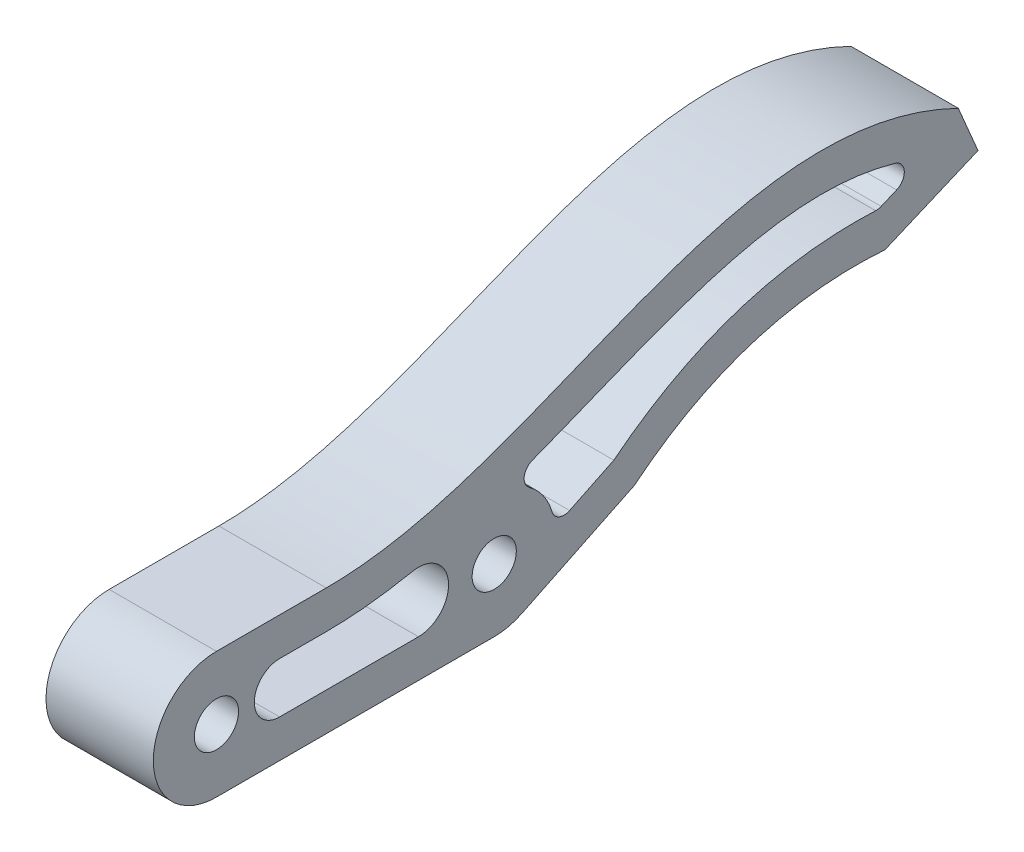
from build123d import *

# Parameters (mm, degrees)
SKETCH1_R           = 1.75
BOSS_EXTRUDE1_DEPTH = 8.5
BOSS_EXTRUDE2_START = -8.5
BOSS_EXTRUDE2_DEPTH = 8.5
CUT_EXTRUDE1_DEPTH  = 69.94975676
FILLET1_R           = 1


with BuildPart() as part:
    # Sketch1 → Boss-Extrude1 (new body)
    with BuildSketch(Plane(origin=(0, 0, 0), x_dir=(0, 0, -1), z_dir=(1, 0, 0))):
        with BuildLine():
            Line((27, 10), (5, 10))
            ThreePointArc((5, 10), (0, 5), (5, 0))
            Line((5, 0), (27, 0))
            ThreePointArc((27, 0), (32, 5), (27, 10))
        make_face()
        with Locations((5, 5)):
            Circle(SKETCH1_R, mode=Mode.SUBTRACT)
        with Locations((27, 5)):
            Circle(SKETCH1_R, mode=Mode.SUBTRACT)
    extrude(amount=BOSS_EXTRUDE1_DEPTH)

    # Sketch2 → Boss-Extrude2 (add)
    with BuildSketch(Plane(origin=(8.5, 0, 0), x_dir=(0, 0, -1), z_dir=(1, 0, 0)).offset(BOSS_EXTRUDE2_START)):
        with BuildLine():
            add(Edge.make_bspline(
                [(63.752972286, 17.872423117), (45.928882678, 26.563787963), (31.059268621, 10), (13.694974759, 10)],
                knots=[0, 0, 0, 0, 1, 1, 1, 1], degree=3))
            Line((13.694974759, 10), (27, 10))
            ThreePointArc((27, 10), (31.87285141, 6.120410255), (29.183837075, 0.502127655))
            Line((29.183837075, 0.502127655), (38.08542066, 4.824084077))
            add(Edge.make_bspline(
                [(38.08542066, 4.824084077), (46.797509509, 11.895222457), (57.948000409, 11.067843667)],
                knots=[0, 0, 0, 1, 1, 1], degree=2))
            Line((57.948000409, 11.067843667), (65.313809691, 14.189518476))
            Line((65.313809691, 14.189518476), (63.752972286, 17.872423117))
        make_face()
    extrude(amount=BOSS_EXTRUDE2_DEPTH)

    # Sketch4 → Cut-Extrude1 (cut, through all)
    with BuildSketch(Plane.ZY):
        with BuildLine():
            Line((-13.694974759, 7), (-10, 7))
            ThreePointArc((-10, 7), (-8, 5), (-10, 3))
            Line((-10, 3), (-21, 3))
            ThreePointArc((-21, 3), (-23.371735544, 5.621446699), (-20.526737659, 7.719803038))
            add(Edge.make_bspline(
                [(-20.526737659, 7.719803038), (-18.317138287, 7.272182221), (-16.039410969, 7), (-13.694974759, 7)],
                knots=[0.878350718, 0.878350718, 0.878350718, 0.878350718, 1, 1, 1, 1], degree=3))
        make_face()
        with BuildLine():
            Line((-31.749281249, 5.082629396), (-36.470582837, 7.374947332))
            add(Edge.make_bspline(
                [(-36.470582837, 7.374947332), (-38.040233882, 8.623312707), (-39.677490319, 9.707638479), (-43.080695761, 11.531837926), (-44.846546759, 12.271381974), (-48.488833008, 13.393385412), (-50.364882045, 13.775726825), (-53.968034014, 14.157804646), (-55.684700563, 14.199141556), (-57.430173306, 14.106683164)],
                knots=[0, 0, 0, 0, 0.25, 0.25, 0.5, 0.5, 0.75, 0.75, 0.969114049, 0.969114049, 0.969114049, 0.969114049], degree=3))
            Line((-57.430173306, 14.106683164), (-61.238801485, 15.72080297))
            add(Edge.make_bspline(
                [(-61.238801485, 15.72080297), (-59.681028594, 16.376692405), (-58.168461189, 16.811623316), (-54.801858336, 17.405904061), (-52.955139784, 17.466162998), (-49.226343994, 17.170644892), (-47.344999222, 16.812481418), (-43.521726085, 15.79231793), (-41.581295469, 15.130313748), (-37.635243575, 13.645174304), (-35.630029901, 12.822392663), (-31.628357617, 11.212316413), (-29.635250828, 10.424982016), (-27.592643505, 9.712883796)],
                knots=[0.025371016, 0.025371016, 0.025371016, 0.025371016, 0.125, 0.125, 0.25, 0.25, 0.375, 0.375, 0.5, 0.5, 0.625, 0.625, 0.744541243, 0.744541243, 0.744541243, 0.744541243], degree=3))
            ThreePointArc((-27.592643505, 9.712883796), (-30.53466462, 8.173112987), (-31.749281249, 5.082629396))
        make_face()
    extrude(amount=-CUT_EXTRUDE1_DEPTH, mode=Mode.SUBTRACT)

    # Fillet1
    fillet1_edges = [part.edges().sort_by_distance(p)[0] for p in [
        (4.25, 5.082629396, -31.749281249),
        (4.25, 9.712883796, -27.592643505),
        (4.25, 14.106683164, -57.430173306),
        (4.25, 15.72080297, -61.238801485),
    ]]
    fillet(fillet1_edges, radius=FILLET1_R)


solid = part.part
